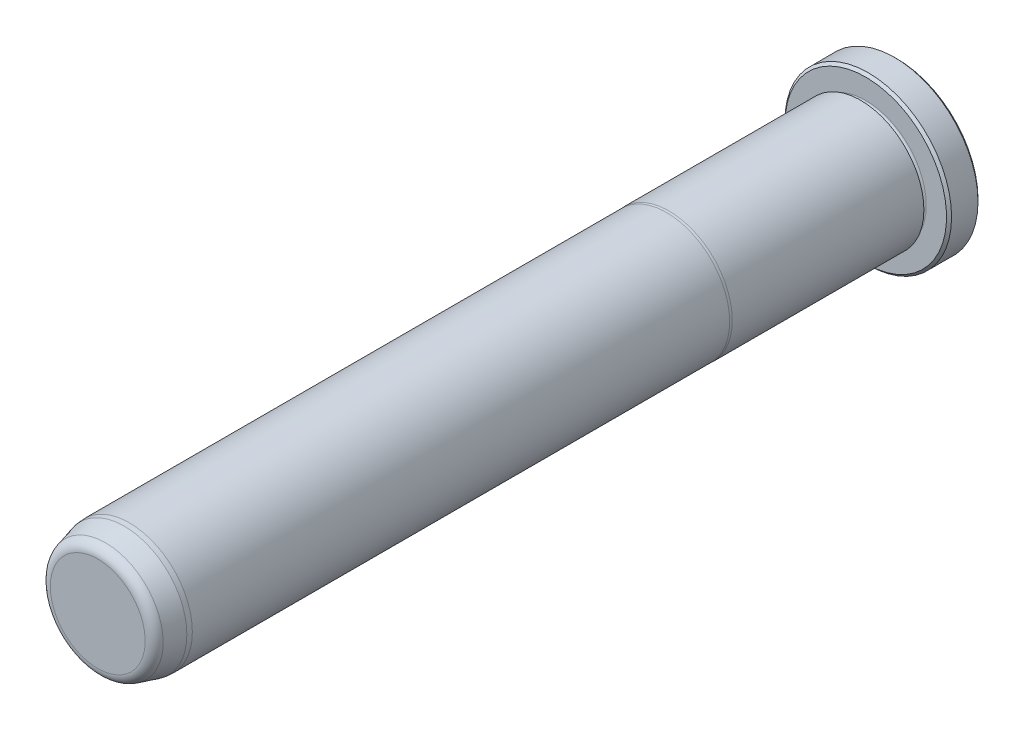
ISO-10303-21;
HEADER;
FILE_DESCRIPTION(('STEP AP214'),'2;1');
FILE_NAME('part.step','',(''),(''),'','','');
FILE_SCHEMA(('AUTOMOTIVE_DESIGN { 1 0 10303 214 1 1 1 1 }'));
ENDSEC;
DATA;
#1=APPLICATION_CONTEXT('core data for automotive mechanical design processes');
#2=APPLICATION_PROTOCOL_DEFINITION('international standard','automotive_design',2000,#1);
#3=PRODUCT_CONTEXT('',#1,'mechanical');
#4=PRODUCT('Part','Part','',(#3));
#5=PRODUCT_RELATED_PRODUCT_CATEGORY('part','',(#4));
#6=PRODUCT_DEFINITION_FORMATION('','',#4);
#7=PRODUCT_DEFINITION_CONTEXT('part definition',#1,'design');
#8=PRODUCT_DEFINITION('design','',#6,#7);
#9=PRODUCT_DEFINITION_SHAPE('','',#8);
#10=(LENGTH_UNIT() NAMED_UNIT(*) SI_UNIT(.MILLI.,.METRE.));
#11=(NAMED_UNIT(*) PLANE_ANGLE_UNIT() SI_UNIT($,.RADIAN.));
#12=(NAMED_UNIT(*) SI_UNIT($,.STERADIAN.) SOLID_ANGLE_UNIT());
#13=UNCERTAINTY_MEASURE_WITH_UNIT(LENGTH_MEASURE(1.E-05),#10,'distance_accuracy_value','');
#14=(GEOMETRIC_REPRESENTATION_CONTEXT(3) GLOBAL_UNCERTAINTY_ASSIGNED_CONTEXT((#13)) GLOBAL_UNIT_ASSIGNED_CONTEXT((#10,
#11,#12)) REPRESENTATION_CONTEXT('',''));
#15=CARTESIAN_POINT('',(0.,0.,0.));
#16=DIRECTION('',(0.,0.,1.));
#17=DIRECTION('',(1.,0.,0.));
#18=AXIS2_PLACEMENT_3D('',#15,#16,#17);
#19=CARTESIAN_POINT('',(0.,0.,0.));
#20=DIRECTION('',(0.,0.,1.));
#21=DIRECTION('',(1.,0.,0.));
#22=AXIS2_PLACEMENT_3D('',#19,#20,#21);
#23=PLANE('',#22);
#24=CARTESIAN_POINT('',(0.,0.,0.));
#25=DIRECTION('',(0.,0.,1.));
#26=DIRECTION('',(1.,0.,0.));
#27=AXIS2_PLACEMENT_3D('',#24,#25,#26);
#28=CIRCLE('',#27,12.192);
#29=CARTESIAN_POINT('',(12.192,0.,0.));
#30=VERTEX_POINT('',#29);
#31=EDGE_CURVE('E37',#30,#30,#28,.F.);
#32=ORIENTED_EDGE('',*,*,#31,.T.);
#33=EDGE_LOOP('',(#32));
#34=FACE_BOUND('',#33,.T.);
#35=ADVANCED_FACE('F30',(#34),#23,.F.);
#36=CARTESIAN_POINT('',(0.,0.,0.));
#37=DIRECTION('',(0.,0.,1.));
#38=DIRECTION('',(1.,0.,0.));
#39=AXIS2_PLACEMENT_3D('',#36,#37,#38);
#40=CYLINDRICAL_SURFACE('',#39,12.573);
#41=CARTESIAN_POINT('',(0.,0.,0.380999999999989));
#42=DIRECTION('',(0.,0.,1.));
#43=DIRECTION('',(1.,0.,0.));
#44=AXIS2_PLACEMENT_3D('',#41,#42,#43);
#45=CIRCLE('',#44,12.573);
#46=CARTESIAN_POINT('',(12.573,0.,0.380999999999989));
#47=VERTEX_POINT('',#46);
#48=EDGE_CURVE('E41',#47,#47,#45,.T.);
#49=ORIENTED_EDGE('',*,*,#48,.T.);
#50=EDGE_LOOP('',(#49));
#51=FACE_BOUND('',#50,.T.);
#52=CARTESIAN_POINT('',(0.,0.,4.36880000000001));
#53=DIRECTION('',(0.,0.,-1.));
#54=DIRECTION('',(-1.,0.,0.));
#55=AXIS2_PLACEMENT_3D('',#52,#53,#54);
#56=CIRCLE('',#55,12.573);
#57=CARTESIAN_POINT('',(-12.573,0.,4.36880000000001));
#58=VERTEX_POINT('',#57);
#59=EDGE_CURVE('E45',#58,#58,#56,.T.);
#60=ORIENTED_EDGE('',*,*,#59,.T.);
#61=EDGE_LOOP('',(#60));
#62=FACE_BOUND('',#61,.T.);
#63=ADVANCED_FACE('F118',(#51,#62),#40,.T.);
#64=CARTESIAN_POINT('',(0.,12.573,4.7498));
#65=DIRECTION('',(0.,0.,-1.));
#66=DIRECTION('',(-1.,0.,0.));
#67=AXIS2_PLACEMENT_3D('',#64,#65,#66);
#68=PLANE('',#67);
#69=CARTESIAN_POINT('',(0.,0.,4.7498));
#70=DIRECTION('',(0.,0.,-1.));
#71=DIRECTION('',(-1.,0.,0.));
#72=AXIS2_PLACEMENT_3D('',#69,#70,#71);
#73=CIRCLE('',#72,12.192);
#74=CARTESIAN_POINT('',(-12.192,0.,4.7498));
#75=VERTEX_POINT('',#74);
#76=EDGE_CURVE('E10',#75,#75,#73,.F.);
#77=ORIENTED_EDGE('',*,*,#76,.T.);
#78=EDGE_LOOP('',(#77));
#79=FACE_BOUND('',#78,.T.);
#80=CARTESIAN_POINT('',(0.,0.,4.7498));
#81=DIRECTION('',(0.,0.,1.));
#82=DIRECTION('',(1.,0.,0.));
#83=AXIS2_PLACEMENT_3D('',#80,#81,#82);
#84=CIRCLE('',#83,9.1313);
#85=CARTESIAN_POINT('',(9.1313,0.,4.7498));
#86=VERTEX_POINT('',#85);
#87=EDGE_CURVE('E56',#86,#86,#84,.T.);
#88=ORIENTED_EDGE('',*,*,#87,.F.);
#89=EDGE_LOOP('',(#88));
#90=FACE_BOUND('',#89,.T.);
#91=ADVANCED_FACE('F113',(#79,#90),#68,.F.);
#92=CARTESIAN_POINT('',(0.,0.,5.1308));
#93=DIRECTION('',(0.,0.,1.));
#94=DIRECTION('',(1.,0.,0.));
#95=AXIS2_PLACEMENT_3D('',#92,#93,#94);
#96=TOROIDAL_SURFACE('',#95,9.1313,0.381);
#97=CARTESIAN_POINT('',(0.,0.,5.5118));
#98=DIRECTION('',(0.,0.,1.));
#99=DIRECTION('',(1.,0.,0.));
#100=AXIS2_PLACEMENT_3D('',#97,#98,#99);
#101=CIRCLE('',#100,9.1313);
#102=CARTESIAN_POINT('',(9.1313,0.,5.5118));
#103=VERTEX_POINT('',#102);
#104=EDGE_CURVE('E59',#103,#103,#101,.T.);
#105=ORIENTED_EDGE('',*,*,#104,.F.);
#106=EDGE_LOOP('',(#105));
#107=FACE_BOUND('',#106,.T.);
#108=ORIENTED_EDGE('',*,*,#87,.T.);
#109=EDGE_LOOP('',(#108));
#110=FACE_BOUND('',#109,.T.);
#111=ADVANCED_FACE('F107',(#107,#110),#96,.F.);
#112=CARTESIAN_POINT('',(0.,9.1313,5.5118));
#113=DIRECTION('',(0.,0.,1.));
#114=DIRECTION('',(1.,0.,0.));
#115=AXIS2_PLACEMENT_3D('',#112,#113,#114);
#116=PLANE('',#115);
#117=CARTESIAN_POINT('',(0.,0.,5.5118));
#118=DIRECTION('',(0.,0.,1.));
#119=DIRECTION('',(1.,0.,0.));
#120=AXIS2_PLACEMENT_3D('',#117,#118,#119);
#121=CIRCLE('',#120,9.5377);
#122=CARTESIAN_POINT('',(9.5377,0.,5.5118));
#123=VERTEX_POINT('',#122);
#124=EDGE_CURVE('E62',#123,#123,#121,.T.);
#125=ORIENTED_EDGE('',*,*,#124,.F.);
#126=EDGE_LOOP('',(#125));
#127=FACE_BOUND('',#126,.T.);
#128=ORIENTED_EDGE('',*,*,#104,.T.);
#129=EDGE_LOOP('',(#128));
#130=FACE_BOUND('',#129,.T.);
#131=ADVANCED_FACE('F101',(#127,#130),#116,.F.);
#132=CARTESIAN_POINT('',(0.,0.,0.));
#133=DIRECTION('',(0.,0.,1.));
#134=DIRECTION('',(1.,0.,0.));
#135=AXIS2_PLACEMENT_3D('',#132,#133,#134);
#136=CYLINDRICAL_SURFACE('',#135,9.5377);
#137=CARTESIAN_POINT('',(0.,0.,34.4347630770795));
#138=DIRECTION('',(0.,0.,1.));
#139=DIRECTION('',(1.,0.,0.));
#140=AXIS2_PLACEMENT_3D('',#137,#138,#139);
#141=CIRCLE('',#140,9.5377);
#142=CARTESIAN_POINT('',(9.5377,0.,34.4347630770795));
#143=VERTEX_POINT('',#142);
#144=EDGE_CURVE('E65',#143,#143,#141,.T.);
#145=ORIENTED_EDGE('',*,*,#144,.F.);
#146=EDGE_LOOP('',(#145));
#147=FACE_BOUND('',#146,.T.);
#148=ORIENTED_EDGE('',*,*,#124,.T.);
#149=EDGE_LOOP('',(#148));
#150=FACE_BOUND('',#149,.T.);
#151=ADVANCED_FACE('F95',(#147,#150),#136,.T.);
#152=CARTESIAN_POINT('',(0.,0.,34.4347630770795));
#153=DIRECTION('',(0.,0.,-1.));
#154=DIRECTION('',(-1.,0.,0.));
#155=AXIS2_PLACEMENT_3D('',#152,#153,#154);
#156=CONICAL_SURFACE('',#155,9.5377,0.0698131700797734);
#157=CARTESIAN_POINT('',(0.,0.,34.798));
#158=DIRECTION('',(0.,0.,1.));
#159=DIRECTION('',(1.,0.,0.));
#160=AXIS2_PLACEMENT_3D('',#157,#158,#159);
#161=CIRCLE('',#160,9.5123);
#162=CARTESIAN_POINT('',(9.5123,0.,34.798));
#163=VERTEX_POINT('',#162);
#164=EDGE_CURVE('E68',#163,#163,#161,.T.);
#165=ORIENTED_EDGE('',*,*,#164,.F.);
#166=EDGE_LOOP('',(#165));
#167=FACE_BOUND('',#166,.T.);
#168=ORIENTED_EDGE('',*,*,#144,.T.);
#169=EDGE_LOOP('',(#168));
#170=FACE_BOUND('',#169,.T.);
#171=ADVANCED_FACE('F89',(#167,#170),#156,.T.);
#172=CARTESIAN_POINT('',(0.,0.,0.));
#173=DIRECTION('',(0.,0.,1.));
#174=DIRECTION('',(1.,0.,0.));
#175=AXIS2_PLACEMENT_3D('',#172,#173,#174);
#176=CYLINDRICAL_SURFACE('',#175,9.51229999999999);
#177=CARTESIAN_POINT('',(0.,0.,115.8875));
#178=DIRECTION('',(0.,0.,1.));
#179=DIRECTION('',(1.,0.,0.));
#180=AXIS2_PLACEMENT_3D('',#177,#178,#179);
#181=CIRCLE('',#180,9.51229999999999);
#182=CARTESIAN_POINT('',(9.51229999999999,0.,115.8875));
#183=VERTEX_POINT('',#182);
#184=EDGE_CURVE('E71',#183,#183,#181,.T.);
#185=ORIENTED_EDGE('',*,*,#184,.F.);
#186=EDGE_LOOP('',(#185));
#187=FACE_BOUND('',#186,.T.);
#188=ORIENTED_EDGE('',*,*,#164,.T.);
#189=EDGE_LOOP('',(#188));
#190=FACE_BOUND('',#189,.T.);
#191=ADVANCED_FACE('F83',(#187,#190),#176,.T.);
#192=CARTESIAN_POINT('',(0.,0.,115.8875));
#193=DIRECTION('',(0.,0.,-1.));
#194=DIRECTION('',(-1.,0.,0.));
#195=AXIS2_PLACEMENT_3D('',#192,#193,#194);
#196=CONICAL_SURFACE('',#195,9.51229999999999,0.0872664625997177);
#197=CARTESIAN_POINT('',(0.,0.,116.6495));
#198=DIRECTION('',(0.,0.,1.));
#199=DIRECTION('',(1.,0.,0.));
#200=AXIS2_PLACEMENT_3D('',#197,#198,#199);
#201=CIRCLE('',#200,9.44563363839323);
#202=CARTESIAN_POINT('',(9.44563363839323,0.,116.6495));
#203=VERTEX_POINT('',#202);
#204=EDGE_CURVE('E74',#203,#203,#201,.T.);
#205=ORIENTED_EDGE('',*,*,#204,.F.);
#206=EDGE_LOOP('',(#205));
#207=FACE_BOUND('',#206,.T.);
#208=ORIENTED_EDGE('',*,*,#184,.T.);
#209=EDGE_LOOP('',(#208));
#210=FACE_BOUND('',#209,.T.);
#211=ADVANCED_FACE('F80',(#207,#210),#196,.T.);
#212=CARTESIAN_POINT('',(0.,0.,116.6495));
#213=DIRECTION('',(0.,0.,-1.));
#214=DIRECTION('',(-1.,0.,0.));
#215=AXIS2_PLACEMENT_3D('',#212,#213,#214);
#216=CONICAL_SURFACE('',#215,9.44563363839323,0.261799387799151);
#217=CARTESIAN_POINT('',(0.,0.,119.4733752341));
#218=DIRECTION('',(0.,0.,1.));
#219=DIRECTION('',(1.,0.,0.));
#220=AXIS2_PLACEMENT_3D('',#217,#218,#219);
#221=CIRCLE('',#220,8.68897854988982);
#222=CARTESIAN_POINT('',(8.68897854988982,0.,119.4733752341));
#223=VERTEX_POINT('',#222);
#224=EDGE_CURVE('E50',#223,#223,#221,.F.);
#225=ORIENTED_EDGE('',*,*,#224,.T.);
#226=EDGE_LOOP('',(#225));
#227=FACE_BOUND('',#226,.T.);
#228=ORIENTED_EDGE('',*,*,#204,.T.);
#229=EDGE_LOOP('',(#228));
#230=FACE_BOUND('',#229,.T.);
#231=ADVANCED_FACE('F78',(#227,#230),#216,.T.);
#232=CARTESIAN_POINT('',(0.,8.37370289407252,120.65));
#233=DIRECTION('',(0.,0.,-1.));
#234=DIRECTION('',(-1.,0.,0.));
#235=AXIS2_PLACEMENT_3D('',#232,#233,#234);
#236=PLANE('',#235);
#237=CARTESIAN_POINT('',(0.,0.,120.65));
#238=DIRECTION('',(0.,0.,-1.));
#239=DIRECTION('',(-1.,0.,0.));
#240=AXIS2_PLACEMENT_3D('',#237,#238,#239);
#241=CIRCLE('',#240,7.15557130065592);
#242=CARTESIAN_POINT('',(-7.15557130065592,0.,120.65));
#243=VERTEX_POINT('',#242);
#244=EDGE_CURVE('E53',#243,#243,#241,.F.);
#245=ORIENTED_EDGE('',*,*,#244,.T.);
#246=EDGE_LOOP('',(#245));
#247=FACE_BOUND('',#246,.T.);
#248=ADVANCED_FACE('F133',(#247),#236,.F.);
#249=CARTESIAN_POINT('',(0.,0.,119.0625));
#250=DIRECTION('',(0.,0.,-1.));
#251=DIRECTION('',(-1.,0.,0.));
#252=AXIS2_PLACEMENT_3D('',#249,#250,#251);
#253=TOROIDAL_SURFACE('',#252,7.15557130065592,1.5875);
#254=ORIENTED_EDGE('',*,*,#224,.F.);
#255=EDGE_LOOP('',(#254));
#256=FACE_BOUND('',#255,.T.);
#257=ORIENTED_EDGE('',*,*,#244,.F.);
#258=EDGE_LOOP('',(#257));
#259=FACE_BOUND('',#258,.T.);
#260=ADVANCED_FACE('F130',(#256,#259),#253,.T.);
#261=CARTESIAN_POINT('',(0.,0.,0.380999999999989));
#262=DIRECTION('',(0.,0.,1.));
#263=DIRECTION('',(1.,0.,0.));
#264=AXIS2_PLACEMENT_3D('',#261,#262,#263);
#265=CONICAL_SURFACE('',#264,12.573,0.785398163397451);
#266=ORIENTED_EDGE('',*,*,#31,.F.);
#267=EDGE_LOOP('',(#266));
#268=FACE_BOUND('',#267,.T.);
#269=ORIENTED_EDGE('',*,*,#48,.F.);
#270=EDGE_LOOP('',(#269));
#271=FACE_BOUND('',#270,.T.);
#272=ADVANCED_FACE('F132',(#268,#271),#265,.T.);
#273=CARTESIAN_POINT('',(0.,0.,4.7498));
#274=DIRECTION('',(0.,0.,-1.));
#275=DIRECTION('',(-1.,0.,0.));
#276=AXIS2_PLACEMENT_3D('',#273,#274,#275);
#277=CONICAL_SURFACE('',#276,12.192,0.785398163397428);
#278=ORIENTED_EDGE('',*,*,#59,.F.);
#279=EDGE_LOOP('',(#278));
#280=FACE_BOUND('',#279,.T.);
#281=ORIENTED_EDGE('',*,*,#76,.F.);
#282=EDGE_LOOP('',(#281));
#283=FACE_BOUND('',#282,.T.);
#284=ADVANCED_FACE('F32',(#280,#283),#277,.T.);
#285=CLOSED_SHELL('',(#35,#63,#91,#111,#131,#151,#171,#191,#211,#231,#248,#260,#272,#284));
#286=MANIFOLD_SOLID_BREP('B2',#285);
#287=ADVANCED_BREP_SHAPE_REPRESENTATION('',(#18,#286),#14);
#288=SHAPE_DEFINITION_REPRESENTATION(#9,#287);
ENDSEC;
END-ISO-10303-21;
